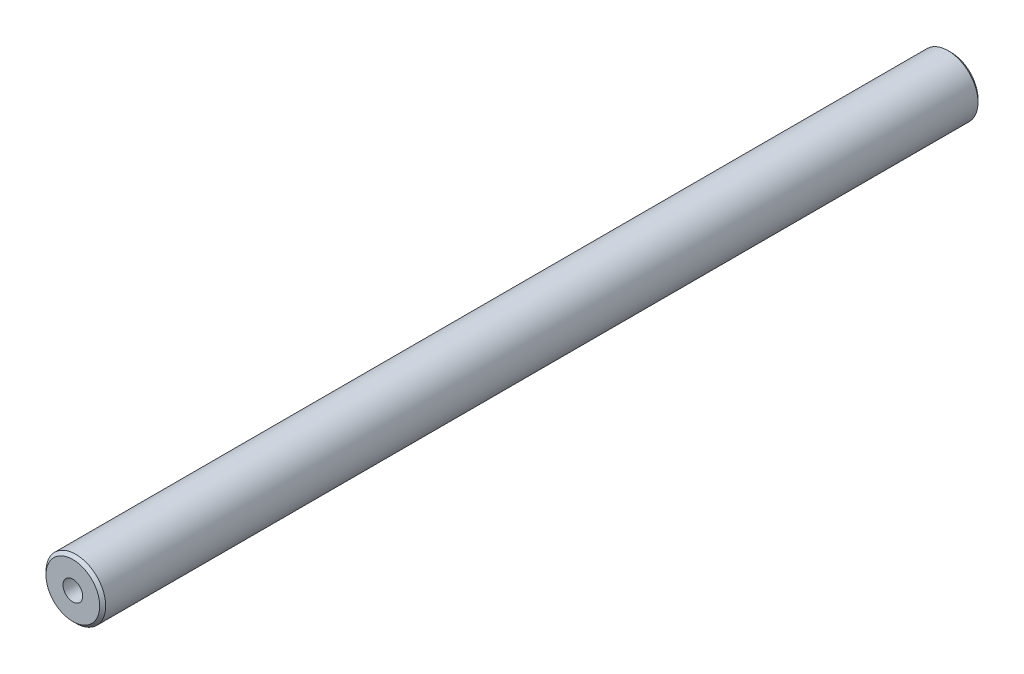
ISO-10303-21;
HEADER;
FILE_DESCRIPTION(('STEP AP214'),'2;1');
FILE_NAME('part.step','',(''),(''),'','','');
FILE_SCHEMA(('AUTOMOTIVE_DESIGN { 1 0 10303 214 1 1 1 1 }'));
ENDSEC;
DATA;
#1=APPLICATION_CONTEXT('core data for automotive mechanical design processes');
#2=APPLICATION_PROTOCOL_DEFINITION('international standard','automotive_design',2000,#1);
#3=PRODUCT_CONTEXT('',#1,'mechanical');
#4=PRODUCT('Part','Part','',(#3));
#5=PRODUCT_RELATED_PRODUCT_CATEGORY('part','',(#4));
#6=PRODUCT_DEFINITION_FORMATION('','',#4);
#7=PRODUCT_DEFINITION_CONTEXT('part definition',#1,'design');
#8=PRODUCT_DEFINITION('design','',#6,#7);
#9=PRODUCT_DEFINITION_SHAPE('','',#8);
#10=(LENGTH_UNIT() NAMED_UNIT(*) SI_UNIT(.MILLI.,.METRE.));
#11=(NAMED_UNIT(*) PLANE_ANGLE_UNIT() SI_UNIT($,.RADIAN.));
#12=(NAMED_UNIT(*) SI_UNIT($,.STERADIAN.) SOLID_ANGLE_UNIT());
#13=UNCERTAINTY_MEASURE_WITH_UNIT(LENGTH_MEASURE(1.E-05),#10,'distance_accuracy_value','');
#14=(GEOMETRIC_REPRESENTATION_CONTEXT(3) GLOBAL_UNCERTAINTY_ASSIGNED_CONTEXT((#13)) GLOBAL_UNIT_ASSIGNED_CONTEXT((#10,
#11,#12)) REPRESENTATION_CONTEXT('',''));
#15=CARTESIAN_POINT('',(0.,0.,0.));
#16=DIRECTION('',(0.,0.,1.));
#17=DIRECTION('',(1.,0.,0.));
#18=AXIS2_PLACEMENT_3D('',#15,#16,#17);
#19=CARTESIAN_POINT('',(0.,0.,73.5));
#20=DIRECTION('',(0.,0.,-1.));
#21=DIRECTION('',(-1.00000000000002,0.,0.));
#22=AXIS2_PLACEMENT_3D('',#19,#20,#21);
#23=CYLINDRICAL_SURFACE('',#22,5.);
#24=CARTESIAN_POINT('',(0.,0.,73.));
#25=DIRECTION('',(0.,0.,1.));
#26=DIRECTION('',(1.00000000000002,0.,0.));
#27=AXIS2_PLACEMENT_3D('',#24,#25,#26);
#28=CIRCLE('',#27,5.);
#29=CARTESIAN_POINT('',(5.00000000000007,1.19236481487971E-13,73.));
#30=VERTEX_POINT('',#29);
#31=EDGE_CURVE('E37',#30,#30,#28,.F.);
#32=ORIENTED_EDGE('',*,*,#31,.T.);
#33=EDGE_LOOP('',(#32));
#34=FACE_BOUND('',#33,.T.);
#35=CARTESIAN_POINT('',(0.,0.,-73.));
#36=DIRECTION('',(0.,0.,1.));
#37=DIRECTION('',(1.00000000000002,0.,0.));
#38=AXIS2_PLACEMENT_3D('',#35,#36,#37);
#39=CIRCLE('',#38,5.);
#40=CARTESIAN_POINT('',(5.00000000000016,0.,-73.));
#41=VERTEX_POINT('',#40);
#42=EDGE_CURVE('E67',#41,#41,#39,.T.);
#43=ORIENTED_EDGE('',*,*,#42,.T.);
#44=EDGE_LOOP('',(#43));
#45=FACE_BOUND('',#44,.T.);
#46=ADVANCED_FACE('F30',(#34,#45),#23,.T.);
#47=CARTESIAN_POINT('',(0.,0.,73.5));
#48=DIRECTION('',(0.,0.,1.));
#49=DIRECTION('',(1.00000000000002,0.,0.));
#50=AXIS2_PLACEMENT_3D('',#47,#48,#49);
#51=PLANE('',#50);
#52=CARTESIAN_POINT('',(0.,0.,73.5));
#53=DIRECTION('',(0.,0.,1.));
#54=DIRECTION('',(1.00000000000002,0.,0.));
#55=AXIS2_PLACEMENT_3D('',#52,#53,#54);
#56=CIRCLE('',#55,4.5);
#57=CARTESIAN_POINT('',(4.50000000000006,1.13736304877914E-13,73.5));
#58=VERTEX_POINT('',#57);
#59=EDGE_CURVE('E64',#58,#58,#56,.T.);
#60=ORIENTED_EDGE('',*,*,#59,.T.);
#61=EDGE_LOOP('',(#60));
#62=FACE_BOUND('',#61,.T.);
#63=CARTESIAN_POINT('',(0.,0.,73.5));
#64=DIRECTION('',(0.,0.,1.));
#65=DIRECTION('',(1.00000000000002,0.,0.));
#66=AXIS2_PLACEMENT_3D('',#63,#64,#65);
#67=CIRCLE('',#66,1.64999999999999);
#68=CARTESIAN_POINT('',(1.64999999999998,0.,73.5));
#69=VERTEX_POINT('',#68);
#70=EDGE_CURVE('E53',#69,#69,#67,.T.);
#71=ORIENTED_EDGE('',*,*,#70,.F.);
#72=EDGE_LOOP('',(#71));
#73=FACE_BOUND('',#72,.T.);
#74=ADVANCED_FACE('F81',(#62,#73),#51,.T.);
#75=CARTESIAN_POINT('',(0.,0.,-73.5));
#76=DIRECTION('',(0.,0.,1.));
#77=DIRECTION('',(1.00000000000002,0.,0.));
#78=AXIS2_PLACEMENT_3D('',#75,#76,#77);
#79=PLANE('',#78);
#80=CARTESIAN_POINT('',(0.,0.,-73.5));
#81=DIRECTION('',(0.,0.,1.));
#82=DIRECTION('',(1.00000000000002,0.,0.));
#83=AXIS2_PLACEMENT_3D('',#80,#81,#82);
#84=CIRCLE('',#83,4.49999999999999);
#85=CARTESIAN_POINT('',(4.50000000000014,0.,-73.5));
#86=VERTEX_POINT('',#85);
#87=EDGE_CURVE('E11',#86,#86,#84,.F.);
#88=ORIENTED_EDGE('',*,*,#87,.T.);
#89=EDGE_LOOP('',(#88));
#90=FACE_BOUND('',#89,.T.);
#91=CARTESIAN_POINT('',(0.,0.,-73.5));
#92=DIRECTION('',(0.,0.,-1.));
#93=DIRECTION('',(-1.00000000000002,0.,0.));
#94=AXIS2_PLACEMENT_3D('',#91,#92,#93);
#95=CIRCLE('',#94,1.64999999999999);
#96=CARTESIAN_POINT('',(-1.64999999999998,0.,-73.5));
#97=VERTEX_POINT('',#96);
#98=EDGE_CURVE('E54',#97,#97,#95,.T.);
#99=ORIENTED_EDGE('',*,*,#98,.F.);
#100=EDGE_LOOP('',(#99));
#101=FACE_BOUND('',#100,.T.);
#102=ADVANCED_FACE('F84',(#90,#101),#79,.F.);
#103=CARTESIAN_POINT('',(0.,0.,63.4));
#104=DIRECTION('',(0.,0.,1.));
#105=DIRECTION('',(1.00000000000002,0.,0.));
#106=AXIS2_PLACEMENT_3D('',#103,#104,#105);
#107=CONICAL_SURFACE('',#106,1.64999999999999,1.02974425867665);
#108=CARTESIAN_POINT('',(0.,0.,62.4085799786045));
#109=VERTEX_POINT('',#108);
#110=VERTEX_LOOP('',#109);
#111=FACE_BOUND('',#110,.T.);
#112=CARTESIAN_POINT('',(0.,0.,63.4));
#113=DIRECTION('',(0.,0.,1.));
#114=DIRECTION('',(1.00000000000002,0.,0.));
#115=AXIS2_PLACEMENT_3D('',#112,#113,#114);
#116=CIRCLE('',#115,1.64999999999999);
#117=CARTESIAN_POINT('',(1.64999999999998,0.,63.4));
#118=VERTEX_POINT('',#117);
#119=EDGE_CURVE('E57',#118,#118,#116,.T.);
#120=ORIENTED_EDGE('',*,*,#119,.T.);
#121=EDGE_LOOP('',(#120));
#122=FACE_BOUND('',#121,.T.);
#123=ADVANCED_FACE('F88',(#111,#122),#107,.F.);
#124=CARTESIAN_POINT('',(0.,0.,73.5));
#125=DIRECTION('',(0.,0.,1.));
#126=DIRECTION('',(1.00000000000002,0.,0.));
#127=AXIS2_PLACEMENT_3D('',#124,#125,#126);
#128=CYLINDRICAL_SURFACE('',#127,1.64999999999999);
#129=ORIENTED_EDGE('',*,*,#119,.F.);
#130=EDGE_LOOP('',(#129));
#131=FACE_BOUND('',#130,.T.);
#132=ORIENTED_EDGE('',*,*,#70,.T.);
#133=EDGE_LOOP('',(#132));
#134=FACE_BOUND('',#133,.T.);
#135=ADVANCED_FACE('F47',(#131,#134),#128,.F.);
#136=CARTESIAN_POINT('',(0.,0.,-63.4));
#137=DIRECTION('',(0.,0.,-1.));
#138=DIRECTION('',(-1.00000000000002,0.,0.));
#139=AXIS2_PLACEMENT_3D('',#136,#137,#138);
#140=CONICAL_SURFACE('',#139,1.64999999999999,1.02974425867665);
#141=CARTESIAN_POINT('',(0.,0.,-62.4085799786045));
#142=VERTEX_POINT('',#141);
#143=VERTEX_LOOP('',#142);
#144=FACE_BOUND('',#143,.T.);
#145=CARTESIAN_POINT('',(0.,0.,-63.4));
#146=DIRECTION('',(0.,0.,-1.));
#147=DIRECTION('',(-1.00000000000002,0.,0.));
#148=AXIS2_PLACEMENT_3D('',#145,#146,#147);
#149=CIRCLE('',#148,1.64999999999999);
#150=CARTESIAN_POINT('',(-1.64999999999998,0.,-63.4));
#151=VERTEX_POINT('',#150);
#152=EDGE_CURVE('E51',#151,#151,#149,.T.);
#153=ORIENTED_EDGE('',*,*,#152,.T.);
#154=EDGE_LOOP('',(#153));
#155=FACE_BOUND('',#154,.T.);
#156=ADVANCED_FACE('F43',(#144,#155),#140,.F.);
#157=CARTESIAN_POINT('',(0.,0.,-73.5));
#158=DIRECTION('',(0.,0.,-1.));
#159=DIRECTION('',(-1.00000000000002,0.,0.));
#160=AXIS2_PLACEMENT_3D('',#157,#158,#159);
#161=CYLINDRICAL_SURFACE('',#160,1.64999999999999);
#162=ORIENTED_EDGE('',*,*,#152,.F.);
#163=EDGE_LOOP('',(#162));
#164=FACE_BOUND('',#163,.T.);
#165=ORIENTED_EDGE('',*,*,#98,.T.);
#166=EDGE_LOOP('',(#165));
#167=FACE_BOUND('',#166,.T.);
#168=ADVANCED_FACE('F46',(#164,#167),#161,.F.);
#169=CARTESIAN_POINT('',(0.,0.,73.5));
#170=DIRECTION('',(0.,0.,-1.));
#171=DIRECTION('',(-1.00000000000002,0.,0.));
#172=AXIS2_PLACEMENT_3D('',#169,#170,#171);
#173=CONICAL_SURFACE('',#172,4.5,0.785398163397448);
#174=ORIENTED_EDGE('',*,*,#31,.F.);
#175=EDGE_LOOP('',(#174));
#176=FACE_BOUND('',#175,.T.);
#177=ORIENTED_EDGE('',*,*,#59,.F.);
#178=EDGE_LOOP('',(#177));
#179=FACE_BOUND('',#178,.T.);
#180=ADVANCED_FACE('F74',(#176,#179),#173,.T.);
#181=CARTESIAN_POINT('',(0.,0.,-73.));
#182=DIRECTION('',(0.,0.,1.));
#183=DIRECTION('',(1.00000000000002,0.,0.));
#184=AXIS2_PLACEMENT_3D('',#181,#182,#183);
#185=CONICAL_SURFACE('',#184,5.,0.785398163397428);
#186=ORIENTED_EDGE('',*,*,#87,.F.);
#187=EDGE_LOOP('',(#186));
#188=FACE_BOUND('',#187,.T.);
#189=ORIENTED_EDGE('',*,*,#42,.F.);
#190=EDGE_LOOP('',(#189));
#191=FACE_BOUND('',#190,.T.);
#192=ADVANCED_FACE('F77',(#188,#191),#185,.T.);
#193=CLOSED_SHELL('',(#46,#74,#102,#123,#135,#156,#168,#180,#192));
#194=MANIFOLD_SOLID_BREP('B2',#193);
#195=ADVANCED_BREP_SHAPE_REPRESENTATION('',(#18,#194),#14);
#196=SHAPE_DEFINITION_REPRESENTATION(#9,#195);
ENDSEC;
END-ISO-10303-21;
